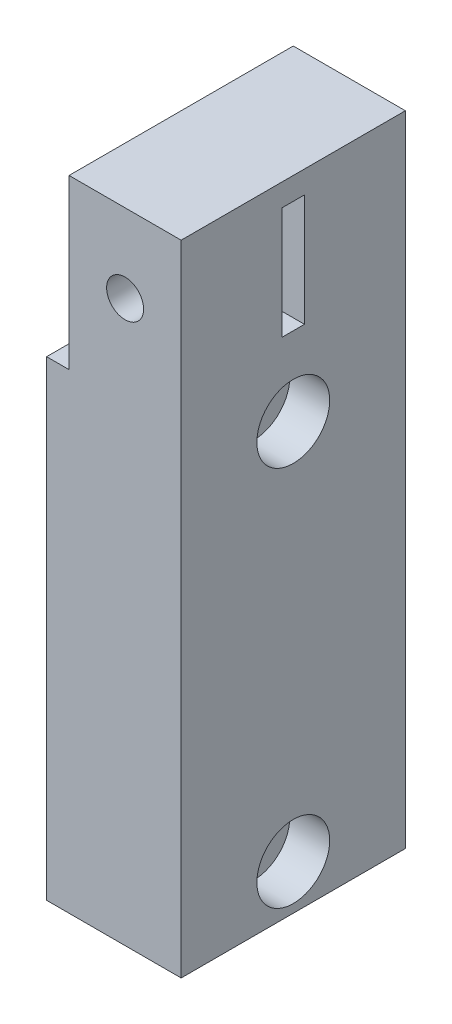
ISO-10303-21;
HEADER;
FILE_DESCRIPTION(('STEP AP214'),'2;1');
FILE_NAME('part.step','',(''),(''),'','','');
FILE_SCHEMA(('AUTOMOTIVE_DESIGN { 1 0 10303 214 1 1 1 1 }'));
ENDSEC;
DATA;
#1=APPLICATION_CONTEXT('core data for automotive mechanical design processes');
#2=APPLICATION_PROTOCOL_DEFINITION('international standard','automotive_design',2000,#1);
#3=PRODUCT_CONTEXT('',#1,'mechanical');
#4=PRODUCT('Part','Part','',(#3));
#5=PRODUCT_RELATED_PRODUCT_CATEGORY('part','',(#4));
#6=PRODUCT_DEFINITION_FORMATION('','',#4);
#7=PRODUCT_DEFINITION_CONTEXT('part definition',#1,'design');
#8=PRODUCT_DEFINITION('design','',#6,#7);
#9=PRODUCT_DEFINITION_SHAPE('','',#8);
#10=(LENGTH_UNIT() NAMED_UNIT(*) SI_UNIT(.MILLI.,.METRE.));
#11=(NAMED_UNIT(*) PLANE_ANGLE_UNIT() SI_UNIT($,.RADIAN.));
#12=(NAMED_UNIT(*) SI_UNIT($,.STERADIAN.) SOLID_ANGLE_UNIT());
#13=UNCERTAINTY_MEASURE_WITH_UNIT(LENGTH_MEASURE(1.E-05),#10,'distance_accuracy_value','');
#14=(GEOMETRIC_REPRESENTATION_CONTEXT(3) GLOBAL_UNCERTAINTY_ASSIGNED_CONTEXT((#13)) GLOBAL_UNIT_ASSIGNED_CONTEXT((#10,
#11,#12)) REPRESENTATION_CONTEXT('',''));
#15=CARTESIAN_POINT('',(0.,0.,0.));
#16=DIRECTION('',(0.,0.,1.));
#17=DIRECTION('',(1.,0.,0.));
#18=AXIS2_PLACEMENT_3D('',#15,#16,#17);
#19=CARTESIAN_POINT('',(-8.,3.99999999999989,10.));
#20=DIRECTION('',(1.,0.,0.));
#21=DIRECTION('',(0.,0.,-1.));
#22=AXIS2_PLACEMENT_3D('',#19,#20,#21);
#23=CYLINDRICAL_SURFACE('',#22,1.75);
#24=CARTESIAN_POINT('',(8.44,3.99999999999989,10.));
#25=DIRECTION('',(1.,0.,0.));
#26=DIRECTION('',(0.,0.,-1.));
#27=AXIS2_PLACEMENT_3D('',#24,#25,#26);
#28=CIRCLE('',#27,1.75);
#29=CARTESIAN_POINT('',(8.44,3.99999999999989,8.25));
#30=VERTEX_POINT('',#29);
#31=EDGE_CURVE('E165',#30,#30,#28,.F.);
#32=ORIENTED_EDGE('',*,*,#31,.F.);
#33=EDGE_LOOP('',(#32));
#34=FACE_BOUND('',#33,.T.);
#35=CARTESIAN_POINT('',(2.,3.99999999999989,10.));
#36=DIRECTION('',(-1.,0.,0.));
#37=DIRECTION('',(0.,0.,1.));
#38=AXIS2_PLACEMENT_3D('',#35,#36,#37);
#39=CIRCLE('',#38,1.75);
#40=CARTESIAN_POINT('',(2.,3.99999999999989,11.75));
#41=VERTEX_POINT('',#40);
#42=EDGE_CURVE('E12',#41,#41,#39,.F.);
#43=ORIENTED_EDGE('',*,*,#42,.F.);
#44=EDGE_LOOP('',(#43));
#45=FACE_BOUND('',#44,.T.);
#46=ADVANCED_FACE('F33',(#34,#45),#23,.F.);
#47=CARTESIAN_POINT('',(-8.,37.9999999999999,10.));
#48=DIRECTION('',(1.,0.,0.));
#49=DIRECTION('',(0.,0.,-1.));
#50=AXIS2_PLACEMENT_3D('',#47,#48,#49);
#51=CYLINDRICAL_SURFACE('',#50,1.75);
#52=CARTESIAN_POINT('',(8.44,37.9999999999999,10.));
#53=DIRECTION('',(1.,0.,0.));
#54=DIRECTION('',(0.,0.,-1.));
#55=AXIS2_PLACEMENT_3D('',#52,#53,#54);
#56=CIRCLE('',#55,1.75);
#57=CARTESIAN_POINT('',(8.44,37.9999999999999,8.25));
#58=VERTEX_POINT('',#57);
#59=EDGE_CURVE('E170',#58,#58,#56,.F.);
#60=ORIENTED_EDGE('',*,*,#59,.F.);
#61=EDGE_LOOP('',(#60));
#62=FACE_BOUND('',#61,.T.);
#63=CARTESIAN_POINT('',(2.,37.9999999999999,10.));
#64=DIRECTION('',(-1.,0.,0.));
#65=DIRECTION('',(0.,0.,1.));
#66=AXIS2_PLACEMENT_3D('',#63,#64,#65);
#67=CIRCLE('',#66,1.75);
#68=CARTESIAN_POINT('',(2.,37.9999999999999,11.75));
#69=VERTEX_POINT('',#68);
#70=EDGE_CURVE('E42',#69,#69,#67,.F.);
#71=ORIENTED_EDGE('',*,*,#70,.F.);
#72=EDGE_LOOP('',(#71));
#73=FACE_BOUND('',#72,.T.);
#74=ADVANCED_FACE('F295',(#62,#73),#51,.F.);
#75=CARTESIAN_POINT('',(0.,0.,20.));
#76=DIRECTION('',(0.,1.,0.));
#77=DIRECTION('',(0.,0.,1.));
#78=AXIS2_PLACEMENT_3D('',#75,#76,#77);
#79=PLANE('',#78);
#80=DIRECTION('',(1.,0.,0.));
#81=VECTOR('',#80,1.);
#82=CARTESIAN_POINT('',(0.,0.,2.));
#83=LINE('',#82,#81);
#84=CARTESIAN_POINT('',(0.,0.,2.));
#85=VERTEX_POINT('',#84);
#86=CARTESIAN_POINT('',(2.,0.,2.));
#87=VERTEX_POINT('',#86);
#88=EDGE_CURVE('E250',#85,#87,#83,.T.);
#89=ORIENTED_EDGE('',*,*,#88,.F.);
#90=DIRECTION('',(0.,0.,-1.));
#91=VECTOR('',#90,1.);
#92=CARTESIAN_POINT('',(0.,0.,20.));
#93=LINE('',#92,#91);
#94=CARTESIAN_POINT('',(0.,0.,0.));
#95=VERTEX_POINT('',#94);
#96=EDGE_CURVE('E194',#85,#95,#93,.T.);
#97=ORIENTED_EDGE('',*,*,#96,.T.);
#98=DIRECTION('',(1.,0.,0.));
#99=VECTOR('',#98,1.);
#100=CARTESIAN_POINT('',(0.,0.,0.));
#101=LINE('',#100,#99);
#102=CARTESIAN_POINT('',(12.,0.,0.));
#103=VERTEX_POINT('',#102);
#104=EDGE_CURVE('E210',#95,#103,#101,.T.);
#105=ORIENTED_EDGE('',*,*,#104,.T.);
#106=DIRECTION('',(0.,0.,-1.));
#107=VECTOR('',#106,1.);
#108=CARTESIAN_POINT('',(12.,0.,20.));
#109=LINE('',#108,#107);
#110=CARTESIAN_POINT('',(12.,0.,20.));
#111=VERTEX_POINT('',#110);
#112=EDGE_CURVE('E183',#111,#103,#109,.T.);
#113=ORIENTED_EDGE('',*,*,#112,.F.);
#114=DIRECTION('',(1.,0.,0.));
#115=VECTOR('',#114,1.);
#116=CARTESIAN_POINT('',(0.,0.,20.));
#117=LINE('',#116,#115);
#118=CARTESIAN_POINT('',(0.,0.,20.));
#119=VERTEX_POINT('',#118);
#120=EDGE_CURVE('E198',#119,#111,#117,.T.);
#121=ORIENTED_EDGE('',*,*,#120,.F.);
#122=CARTESIAN_POINT('',(0.,0.,18.));
#123=VERTEX_POINT('',#122);
#124=EDGE_CURVE('E192',#119,#123,#93,.T.);
#125=ORIENTED_EDGE('',*,*,#124,.T.);
#126=DIRECTION('',(-1.,0.,0.));
#127=VECTOR('',#126,1.);
#128=CARTESIAN_POINT('',(0.,0.,18.));
#129=LINE('',#128,#127);
#130=CARTESIAN_POINT('',(2.,0.,18.));
#131=VERTEX_POINT('',#130);
#132=EDGE_CURVE('E55',#131,#123,#129,.T.);
#133=ORIENTED_EDGE('',*,*,#132,.F.);
#134=DIRECTION('',(0.,0.,1.));
#135=VECTOR('',#134,1.);
#136=CARTESIAN_POINT('',(2.,0.,20.));
#137=LINE('',#136,#135);
#138=EDGE_CURVE('E50',#87,#131,#137,.T.);
#139=ORIENTED_EDGE('',*,*,#138,.F.);
#140=EDGE_LOOP('',(#89,#97,#105,#113,#121,#125,#133,#139));
#141=FACE_BOUND('',#140,.T.);
#142=ADVANCED_FACE('F35',(#141),#79,.F.);
#143=CARTESIAN_POINT('',(0.,42.,20.));
#144=DIRECTION('',(0.,-1.,0.));
#145=DIRECTION('',(0.,0.,-1.));
#146=AXIS2_PLACEMENT_3D('',#143,#144,#145);
#147=PLANE('',#146);
#148=DIRECTION('',(-1.,0.,0.));
#149=VECTOR('',#148,1.);
#150=CARTESIAN_POINT('',(0.,42.,2.));
#151=LINE('',#150,#149);
#152=CARTESIAN_POINT('',(2.,42.,2.));
#153=VERTEX_POINT('',#152);
#154=CARTESIAN_POINT('',(0.,42.,2.));
#155=VERTEX_POINT('',#154);
#156=EDGE_CURVE('E254',#153,#155,#151,.T.);
#157=ORIENTED_EDGE('',*,*,#156,.F.);
#158=DIRECTION('',(0.,0.,-1.));
#159=VECTOR('',#158,1.);
#160=CARTESIAN_POINT('',(2.,42.,20.));
#161=LINE('',#160,#159);
#162=CARTESIAN_POINT('',(2.,42.,0.));
#163=VERTEX_POINT('',#162);
#164=EDGE_CURVE('E144',#153,#163,#161,.T.);
#165=ORIENTED_EDGE('',*,*,#164,.T.);
#166=DIRECTION('',(-1.,0.,0.));
#167=VECTOR('',#166,1.);
#168=CARTESIAN_POINT('',(0.,42.,0.));
#169=LINE('',#168,#167);
#170=CARTESIAN_POINT('',(0.,42.,0.));
#171=VERTEX_POINT('',#170);
#172=EDGE_CURVE('E199',#163,#171,#169,.T.);
#173=ORIENTED_EDGE('',*,*,#172,.T.);
#174=DIRECTION('',(0.,0.,-1.));
#175=VECTOR('',#174,1.);
#176=CARTESIAN_POINT('',(0.,42.,20.));
#177=LINE('',#176,#175);
#178=EDGE_CURVE('E145',#155,#171,#177,.T.);
#179=ORIENTED_EDGE('',*,*,#178,.F.);
#180=EDGE_LOOP('',(#157,#165,#173,#179));
#181=FACE_BOUND('',#180,.T.);
#182=ADVANCED_FACE('F336',(#181),#147,.F.);
#183=DIRECTION('',(1.,0.,0.));
#184=VECTOR('',#183,1.);
#185=CARTESIAN_POINT('',(0.,42.,18.));
#186=LINE('',#185,#184);
#187=CARTESIAN_POINT('',(0.,42.0000000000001,18.));
#188=VERTEX_POINT('',#187);
#189=CARTESIAN_POINT('',(2.,42.,18.));
#190=VERTEX_POINT('',#189);
#191=EDGE_CURVE('E148',#188,#190,#186,.T.);
#192=ORIENTED_EDGE('',*,*,#191,.F.);
#193=CARTESIAN_POINT('',(0.,42.,20.));
#194=VERTEX_POINT('',#193);
#195=EDGE_CURVE('E135',#194,#188,#177,.T.);
#196=ORIENTED_EDGE('',*,*,#195,.F.);
#197=DIRECTION('',(-1.,0.,0.));
#198=VECTOR('',#197,1.);
#199=CARTESIAN_POINT('',(0.,42.,20.));
#200=LINE('',#199,#198);
#201=CARTESIAN_POINT('',(2.,42.,20.));
#202=VERTEX_POINT('',#201);
#203=EDGE_CURVE('E215',#202,#194,#200,.T.);
#204=ORIENTED_EDGE('',*,*,#203,.F.);
#205=EDGE_CURVE('E151',#202,#190,#161,.T.);
#206=ORIENTED_EDGE('',*,*,#205,.T.);
#207=EDGE_LOOP('',(#192,#196,#204,#206));
#208=FACE_BOUND('',#207,.T.);
#209=ADVANCED_FACE('F149',(#208),#147,.F.);
#210=CARTESIAN_POINT('',(0.,0.,20.));
#211=DIRECTION('',(1.,0.,0.));
#212=DIRECTION('',(0.,0.,-1.));
#213=AXIS2_PLACEMENT_3D('',#210,#211,#212);
#214=PLANE('',#213);
#215=DIRECTION('',(0.,-1.,0.));
#216=VECTOR('',#215,1.);
#217=CARTESIAN_POINT('',(0.,0.,2.));
#218=LINE('',#217,#216);
#219=EDGE_CURVE('E157',#155,#85,#218,.T.);
#220=ORIENTED_EDGE('',*,*,#219,.F.);
#221=ORIENTED_EDGE('',*,*,#178,.T.);
#222=DIRECTION('',(0.,-1.,0.));
#223=VECTOR('',#222,1.);
#224=CARTESIAN_POINT('',(0.,0.,0.));
#225=LINE('',#224,#223);
#226=EDGE_CURVE('E195',#171,#95,#225,.T.);
#227=ORIENTED_EDGE('',*,*,#226,.T.);
#228=ORIENTED_EDGE('',*,*,#96,.F.);
#229=EDGE_LOOP('',(#220,#221,#227,#228));
#230=FACE_BOUND('',#229,.T.);
#231=ADVANCED_FACE('F332',(#230),#214,.F.);
#232=DIRECTION('',(0.,1.,0.));
#233=VECTOR('',#232,1.);
#234=CARTESIAN_POINT('',(0.,0.,18.));
#235=LINE('',#234,#233);
#236=EDGE_CURVE('E140',#123,#188,#235,.T.);
#237=ORIENTED_EDGE('',*,*,#236,.F.);
#238=ORIENTED_EDGE('',*,*,#124,.F.);
#239=DIRECTION('',(0.,-1.,0.));
#240=VECTOR('',#239,1.);
#241=CARTESIAN_POINT('',(0.,0.,20.));
#242=LINE('',#241,#240);
#243=EDGE_CURVE('E141',#194,#119,#242,.T.);
#244=ORIENTED_EDGE('',*,*,#243,.F.);
#245=ORIENTED_EDGE('',*,*,#195,.T.);
#246=EDGE_LOOP('',(#237,#238,#244,#245));
#247=FACE_BOUND('',#246,.T.);
#248=ADVANCED_FACE('F137',(#247),#214,.F.);
#249=CARTESIAN_POINT('',(12.,0.,20.));
#250=DIRECTION('',(-1.,0.,0.));
#251=DIRECTION('',(0.,0.,1.));
#252=AXIS2_PLACEMENT_3D('',#249,#250,#251);
#253=PLANE('',#252);
#254=CARTESIAN_POINT('',(12.,3.99999999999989,10.));
#255=DIRECTION('',(1.,0.,0.));
#256=DIRECTION('',(0.,0.,-1.));
#257=AXIS2_PLACEMENT_3D('',#254,#255,#256);
#258=CIRCLE('',#257,3.25);
#259=CARTESIAN_POINT('',(12.,3.99999999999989,6.75));
#260=VERTEX_POINT('',#259);
#261=EDGE_CURVE('E247',#260,#260,#258,.T.);
#262=ORIENTED_EDGE('',*,*,#261,.F.);
#263=EDGE_LOOP('',(#262));
#264=FACE_BOUND('',#263,.T.);
#265=CARTESIAN_POINT('',(12.,37.9999999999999,10.));
#266=DIRECTION('',(1.,0.,0.));
#267=DIRECTION('',(0.,0.,-1.));
#268=AXIS2_PLACEMENT_3D('',#265,#266,#267);
#269=CIRCLE('',#268,3.25);
#270=CARTESIAN_POINT('',(12.,37.9999999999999,6.75));
#271=VERTEX_POINT('',#270);
#272=EDGE_CURVE('E168',#271,#271,#269,.T.);
#273=ORIENTED_EDGE('',*,*,#272,.F.);
#274=EDGE_LOOP('',(#273));
#275=FACE_BOUND('',#274,.T.);
#276=DIRECTION('',(0.,0.,-1.));
#277=VECTOR('',#276,1.);
#278=CARTESIAN_POINT('',(12.,45.,11.));
#279=LINE('',#278,#277);
#280=CARTESIAN_POINT('',(12.,45.,11.));
#281=VERTEX_POINT('',#280);
#282=CARTESIAN_POINT('',(12.,45.,9.));
#283=VERTEX_POINT('',#282);
#284=EDGE_CURVE('E239',#281,#283,#279,.T.);
#285=ORIENTED_EDGE('',*,*,#284,.F.);
#286=DIRECTION('',(0.,-1.,0.));
#287=VECTOR('',#286,1.);
#288=CARTESIAN_POINT('',(12.,45.,11.));
#289=LINE('',#288,#287);
#290=CARTESIAN_POINT('',(12.,55.,11.));
#291=VERTEX_POINT('',#290);
#292=EDGE_CURVE('E172',#291,#281,#289,.T.);
#293=ORIENTED_EDGE('',*,*,#292,.F.);
#294=DIRECTION('',(0.,0.,1.));
#295=VECTOR('',#294,1.);
#296=CARTESIAN_POINT('',(12.,55.,11.));
#297=LINE('',#296,#295);
#298=CARTESIAN_POINT('',(12.,55.,9.));
#299=VERTEX_POINT('',#298);
#300=EDGE_CURVE('E229',#299,#291,#297,.T.);
#301=ORIENTED_EDGE('',*,*,#300,.F.);
#302=DIRECTION('',(0.,1.,0.));
#303=VECTOR('',#302,1.);
#304=CARTESIAN_POINT('',(12.,45.,9.));
#305=LINE('',#304,#303);
#306=EDGE_CURVE('E236',#283,#299,#305,.T.);
#307=ORIENTED_EDGE('',*,*,#306,.F.);
#308=EDGE_LOOP('',(#285,#293,#301,#307));
#309=FACE_BOUND('',#308,.T.);
#310=DIRECTION('',(0.,1.,0.));
#311=VECTOR('',#310,1.);
#312=CARTESIAN_POINT('',(12.,0.,0.));
#313=LINE('',#312,#311);
#314=CARTESIAN_POINT('',(12.,57.,0.));
#315=VERTEX_POINT('',#314);
#316=EDGE_CURVE('E208',#103,#315,#313,.T.);
#317=ORIENTED_EDGE('',*,*,#316,.T.);
#318=DIRECTION('',(0.,0.,-1.));
#319=VECTOR('',#318,1.);
#320=CARTESIAN_POINT('',(12.,57.,20.));
#321=LINE('',#320,#319);
#322=CARTESIAN_POINT('',(12.,57.,20.));
#323=VERTEX_POINT('',#322);
#324=EDGE_CURVE('E186',#323,#315,#321,.T.);
#325=ORIENTED_EDGE('',*,*,#324,.F.);
#326=DIRECTION('',(0.,1.,0.));
#327=VECTOR('',#326,1.);
#328=CARTESIAN_POINT('',(12.,0.,20.));
#329=LINE('',#328,#327);
#330=EDGE_CURVE('E221',#111,#323,#329,.T.);
#331=ORIENTED_EDGE('',*,*,#330,.F.);
#332=ORIENTED_EDGE('',*,*,#112,.T.);
#333=EDGE_LOOP('',(#317,#325,#331,#332));
#334=FACE_BOUND('',#333,.T.);
#335=ADVANCED_FACE('F345',(#264,#275,#309,#334),#253,.F.);
#336=CARTESIAN_POINT('',(2.,57.,20.));
#337=DIRECTION('',(0.,-1.,0.));
#338=DIRECTION('',(0.,0.,-1.));
#339=AXIS2_PLACEMENT_3D('',#336,#337,#338);
#340=PLANE('',#339);
#341=DIRECTION('',(-1.,0.,0.));
#342=VECTOR('',#341,1.);
#343=CARTESIAN_POINT('',(2.,57.,0.));
#344=LINE('',#343,#342);
#345=CARTESIAN_POINT('',(2.,57.,0.));
#346=VERTEX_POINT('',#345);
#347=EDGE_CURVE('E205',#315,#346,#344,.T.);
#348=ORIENTED_EDGE('',*,*,#347,.T.);
#349=DIRECTION('',(0.,0.,-1.));
#350=VECTOR('',#349,1.);
#351=CARTESIAN_POINT('',(2.,57.,20.));
#352=LINE('',#351,#350);
#353=CARTESIAN_POINT('',(2.,57.,20.));
#354=VERTEX_POINT('',#353);
#355=EDGE_CURVE('E189',#354,#346,#352,.T.);
#356=ORIENTED_EDGE('',*,*,#355,.F.);
#357=DIRECTION('',(-1.,0.,0.));
#358=VECTOR('',#357,1.);
#359=CARTESIAN_POINT('',(2.,57.,20.));
#360=LINE('',#359,#358);
#361=EDGE_CURVE('E219',#323,#354,#360,.T.);
#362=ORIENTED_EDGE('',*,*,#361,.F.);
#363=ORIENTED_EDGE('',*,*,#324,.T.);
#364=EDGE_LOOP('',(#348,#356,#362,#363));
#365=FACE_BOUND('',#364,.T.);
#366=ADVANCED_FACE('F342',(#365),#340,.F.);
#367=CARTESIAN_POINT('',(2.,42.,20.));
#368=DIRECTION('',(1.,0.,0.));
#369=DIRECTION('',(0.,0.,-1.));
#370=AXIS2_PLACEMENT_3D('',#367,#368,#369);
#371=PLANE('',#370);
#372=DIRECTION('',(0.,0.,1.));
#373=VECTOR('',#372,1.);
#374=CARTESIAN_POINT('',(2.,55.,20.));
#375=LINE('',#374,#373);
#376=CARTESIAN_POINT('',(2.,55.,9.));
#377=VERTEX_POINT('',#376);
#378=CARTESIAN_POINT('',(2.,55.,11.));
#379=VERTEX_POINT('',#378);
#380=EDGE_CURVE('E162',#377,#379,#375,.T.);
#381=ORIENTED_EDGE('',*,*,#380,.T.);
#382=DIRECTION('',(0.,-1.,0.));
#383=VECTOR('',#382,1.);
#384=CARTESIAN_POINT('',(2.,42.,11.));
#385=LINE('',#384,#383);
#386=CARTESIAN_POINT('',(2.,45.,11.));
#387=VERTEX_POINT('',#386);
#388=EDGE_CURVE('E158',#379,#387,#385,.T.);
#389=ORIENTED_EDGE('',*,*,#388,.T.);
#390=DIRECTION('',(0.,0.,-1.));
#391=VECTOR('',#390,1.);
#392=CARTESIAN_POINT('',(2.,45.,20.));
#393=LINE('',#392,#391);
#394=CARTESIAN_POINT('',(2.,45.,9.));
#395=VERTEX_POINT('',#394);
#396=EDGE_CURVE('E180',#387,#395,#393,.T.);
#397=ORIENTED_EDGE('',*,*,#396,.T.);
#398=DIRECTION('',(0.,1.,0.));
#399=VECTOR('',#398,1.);
#400=CARTESIAN_POINT('',(2.,42.,9.));
#401=LINE('',#400,#399);
#402=EDGE_CURVE('E177',#395,#377,#401,.T.);
#403=ORIENTED_EDGE('',*,*,#402,.T.);
#404=EDGE_LOOP('',(#381,#389,#397,#403));
#405=FACE_BOUND('',#404,.T.);
#406=ORIENTED_EDGE('',*,*,#355,.T.);
#407=DIRECTION('',(0.,-1.,0.));
#408=VECTOR('',#407,1.);
#409=CARTESIAN_POINT('',(2.,42.,0.));
#410=LINE('',#409,#408);
#411=EDGE_CURVE('E202',#346,#163,#410,.T.);
#412=ORIENTED_EDGE('',*,*,#411,.T.);
#413=ORIENTED_EDGE('',*,*,#164,.F.);
#414=DIRECTION('',(0.,-1.,0.));
#415=VECTOR('',#414,1.);
#416=CARTESIAN_POINT('',(2.,200.234170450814,2.));
#417=LINE('',#416,#415);
#418=EDGE_CURVE('E261',#153,#87,#417,.T.);
#419=ORIENTED_EDGE('',*,*,#418,.T.);
#420=ORIENTED_EDGE('',*,*,#138,.T.);
#421=DIRECTION('',(0.,-1.,0.));
#422=VECTOR('',#421,1.);
#423=CARTESIAN_POINT('',(2.,200.234170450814,18.));
#424=LINE('',#423,#422);
#425=EDGE_CURVE('E264',#190,#131,#424,.T.);
#426=ORIENTED_EDGE('',*,*,#425,.F.);
#427=ORIENTED_EDGE('',*,*,#205,.F.);
#428=DIRECTION('',(0.,-1.,0.));
#429=VECTOR('',#428,1.);
#430=CARTESIAN_POINT('',(2.,42.,20.));
#431=LINE('',#430,#429);
#432=EDGE_CURVE('E217',#354,#202,#431,.T.);
#433=ORIENTED_EDGE('',*,*,#432,.F.);
#434=EDGE_LOOP('',(#406,#412,#413,#419,#420,#426,#427,#433));
#435=FACE_BOUND('',#434,.T.);
#436=ORIENTED_EDGE('',*,*,#70,.T.);
#437=EDGE_LOOP('',(#436));
#438=FACE_BOUND('',#437,.T.);
#439=ORIENTED_EDGE('',*,*,#42,.T.);
#440=EDGE_LOOP('',(#439));
#441=FACE_BOUND('',#440,.T.);
#442=ADVANCED_FACE('F328',(#405,#435,#438,#441),#371,.F.);
#443=CARTESIAN_POINT('',(12.,0.,20.));
#444=DIRECTION('',(0.,0.,1.));
#445=DIRECTION('',(1.,0.,0.));
#446=AXIS2_PLACEMENT_3D('',#443,#444,#445);
#447=PLANE('',#446);
#448=CARTESIAN_POINT('',(7.,50.,20.));
#449=DIRECTION('',(0.,0.,1.));
#450=DIRECTION('',(1.,0.,0.));
#451=AXIS2_PLACEMENT_3D('',#448,#449,#450);
#452=CIRCLE('',#451,1.64999999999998);
#453=CARTESIAN_POINT('',(8.64999999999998,50.,20.));
#454=VERTEX_POINT('',#453);
#455=EDGE_CURVE('E269',#454,#454,#452,.T.);
#456=ORIENTED_EDGE('',*,*,#455,.F.);
#457=EDGE_LOOP('',(#456));
#458=FACE_BOUND('',#457,.T.);
#459=ORIENTED_EDGE('',*,*,#120,.T.);
#460=ORIENTED_EDGE('',*,*,#330,.T.);
#461=ORIENTED_EDGE('',*,*,#361,.T.);
#462=ORIENTED_EDGE('',*,*,#432,.T.);
#463=ORIENTED_EDGE('',*,*,#203,.T.);
#464=ORIENTED_EDGE('',*,*,#243,.T.);
#465=EDGE_LOOP('',(#459,#460,#461,#462,#463,#464));
#466=FACE_BOUND('',#465,.T.);
#467=ADVANCED_FACE('F325',(#458,#466),#447,.T.);
#468=CARTESIAN_POINT('',(12.,0.,0.));
#469=DIRECTION('',(0.,0.,1.));
#470=DIRECTION('',(1.,0.,0.));
#471=AXIS2_PLACEMENT_3D('',#468,#469,#470);
#472=PLANE('',#471);
#473=CARTESIAN_POINT('',(7.,50.,0.));
#474=DIRECTION('',(0.,0.,1.));
#475=DIRECTION('',(1.,0.,0.));
#476=AXIS2_PLACEMENT_3D('',#473,#474,#475);
#477=CIRCLE('',#476,1.64999999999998);
#478=CARTESIAN_POINT('',(8.64999999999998,50.,0.));
#479=VERTEX_POINT('',#478);
#480=EDGE_CURVE('E272',#479,#479,#477,.T.);
#481=ORIENTED_EDGE('',*,*,#480,.T.);
#482=EDGE_LOOP('',(#481));
#483=FACE_BOUND('',#482,.T.);
#484=ORIENTED_EDGE('',*,*,#104,.F.);
#485=ORIENTED_EDGE('',*,*,#226,.F.);
#486=ORIENTED_EDGE('',*,*,#172,.F.);
#487=ORIENTED_EDGE('',*,*,#411,.F.);
#488=ORIENTED_EDGE('',*,*,#347,.F.);
#489=ORIENTED_EDGE('',*,*,#316,.F.);
#490=EDGE_LOOP('',(#484,#485,#486,#487,#488,#489));
#491=FACE_BOUND('',#490,.T.);
#492=ADVANCED_FACE('F323',(#483,#491),#472,.F.);
#493=CARTESIAN_POINT('',(-8.,45.,11.));
#494=DIRECTION('',(0.,0.,1.));
#495=DIRECTION('',(1.,0.,0.));
#496=AXIS2_PLACEMENT_3D('',#493,#494,#495);
#497=PLANE('',#496);
#498=CARTESIAN_POINT('',(7.,50.,11.));
#499=DIRECTION('',(0.,0.,1.));
#500=DIRECTION('',(1.,0.,0.));
#501=AXIS2_PLACEMENT_3D('',#498,#499,#500);
#502=CIRCLE('',#501,1.64999999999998);
#503=CARTESIAN_POINT('',(8.64999999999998,50.,11.));
#504=VERTEX_POINT('',#503);
#505=EDGE_CURVE('E266',#504,#504,#502,.T.);
#506=ORIENTED_EDGE('',*,*,#505,.T.);
#507=EDGE_LOOP('',(#506));
#508=FACE_BOUND('',#507,.T.);
#509=DIRECTION('',(1.,0.,0.));
#510=VECTOR('',#509,1.);
#511=CARTESIAN_POINT('',(-8.,55.,11.));
#512=LINE('',#511,#510);
#513=EDGE_CURVE('E213',#379,#291,#512,.T.);
#514=ORIENTED_EDGE('',*,*,#513,.T.);
#515=ORIENTED_EDGE('',*,*,#292,.T.);
#516=DIRECTION('',(1.,0.,0.));
#517=VECTOR('',#516,1.);
#518=CARTESIAN_POINT('',(-8.,45.,11.));
#519=LINE('',#518,#517);
#520=EDGE_CURVE('E225',#387,#281,#519,.T.);
#521=ORIENTED_EDGE('',*,*,#520,.F.);
#522=ORIENTED_EDGE('',*,*,#388,.F.);
#523=EDGE_LOOP('',(#514,#515,#521,#522));
#524=FACE_BOUND('',#523,.T.);
#525=ADVANCED_FACE('F312',(#508,#524),#497,.F.);
#526=CARTESIAN_POINT('',(-8.,55.,11.));
#527=DIRECTION('',(0.,1.,0.));
#528=DIRECTION('',(0.,0.,1.));
#529=AXIS2_PLACEMENT_3D('',#526,#527,#528);
#530=PLANE('',#529);
#531=DIRECTION('',(1.,0.,0.));
#532=VECTOR('',#531,1.);
#533=CARTESIAN_POINT('',(-8.,55.,9.));
#534=LINE('',#533,#532);
#535=EDGE_CURVE('E231',#377,#299,#534,.T.);
#536=ORIENTED_EDGE('',*,*,#535,.T.);
#537=ORIENTED_EDGE('',*,*,#300,.T.);
#538=ORIENTED_EDGE('',*,*,#513,.F.);
#539=ORIENTED_EDGE('',*,*,#380,.F.);
#540=EDGE_LOOP('',(#536,#537,#538,#539));
#541=FACE_BOUND('',#540,.T.);
#542=ADVANCED_FACE('F309',(#541),#530,.F.);
#543=CARTESIAN_POINT('',(-8.,45.,9.));
#544=DIRECTION('',(0.,0.,-1.));
#545=DIRECTION('',(-1.,0.,0.));
#546=AXIS2_PLACEMENT_3D('',#543,#544,#545);
#547=PLANE('',#546);
#548=CARTESIAN_POINT('',(7.,50.,9.));
#549=DIRECTION('',(0.,0.,-1.));
#550=DIRECTION('',(-1.,0.,0.));
#551=AXIS2_PLACEMENT_3D('',#548,#549,#550);
#552=CIRCLE('',#551,1.64999999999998);
#553=CARTESIAN_POINT('',(5.35000000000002,50.,9.));
#554=VERTEX_POINT('',#553);
#555=EDGE_CURVE('E37',#554,#554,#552,.T.);
#556=ORIENTED_EDGE('',*,*,#555,.T.);
#557=EDGE_LOOP('',(#556));
#558=FACE_BOUND('',#557,.T.);
#559=DIRECTION('',(1.,0.,0.));
#560=VECTOR('',#559,1.);
#561=CARTESIAN_POINT('',(-8.,45.,9.));
#562=LINE('',#561,#560);
#563=EDGE_CURVE('E228',#395,#283,#562,.T.);
#564=ORIENTED_EDGE('',*,*,#563,.T.);
#565=ORIENTED_EDGE('',*,*,#306,.T.);
#566=ORIENTED_EDGE('',*,*,#535,.F.);
#567=ORIENTED_EDGE('',*,*,#402,.F.);
#568=EDGE_LOOP('',(#564,#565,#566,#567));
#569=FACE_BOUND('',#568,.T.);
#570=ADVANCED_FACE('F279',(#558,#569),#547,.F.);
#571=CARTESIAN_POINT('',(-8.,45.,11.));
#572=DIRECTION('',(0.,-1.,0.));
#573=DIRECTION('',(0.,0.,-1.));
#574=AXIS2_PLACEMENT_3D('',#571,#572,#573);
#575=PLANE('',#574);
#576=ORIENTED_EDGE('',*,*,#520,.T.);
#577=ORIENTED_EDGE('',*,*,#284,.T.);
#578=ORIENTED_EDGE('',*,*,#563,.F.);
#579=ORIENTED_EDGE('',*,*,#396,.F.);
#580=EDGE_LOOP('',(#576,#577,#578,#579));
#581=FACE_BOUND('',#580,.T.);
#582=ADVANCED_FACE('F316',(#581),#575,.F.);
#583=CARTESIAN_POINT('',(8.44,37.9999999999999,10.));
#584=DIRECTION('',(1.,0.,0.));
#585=DIRECTION('',(0.,0.,-1.));
#586=AXIS2_PLACEMENT_3D('',#583,#584,#585);
#587=PLANE('',#586);
#588=CARTESIAN_POINT('',(8.44,37.9999999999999,10.));
#589=DIRECTION('',(1.,0.,0.));
#590=DIRECTION('',(0.,0.,-1.));
#591=AXIS2_PLACEMENT_3D('',#588,#589,#590);
#592=CIRCLE('',#591,3.25);
#593=CARTESIAN_POINT('',(8.44,37.9999999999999,6.75));
#594=VERTEX_POINT('',#593);
#595=EDGE_CURVE('E173',#594,#594,#592,.T.);
#596=ORIENTED_EDGE('',*,*,#595,.T.);
#597=EDGE_LOOP('',(#596));
#598=FACE_BOUND('',#597,.T.);
#599=ORIENTED_EDGE('',*,*,#59,.T.);
#600=EDGE_LOOP('',(#599));
#601=FACE_BOUND('',#600,.T.);
#602=ADVANCED_FACE('F319',(#598,#601),#587,.T.);
#603=CARTESIAN_POINT('',(8.44,37.9999999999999,10.));
#604=DIRECTION('',(1.,0.,0.));
#605=DIRECTION('',(0.,0.,-1.));
#606=AXIS2_PLACEMENT_3D('',#603,#604,#605);
#607=CYLINDRICAL_SURFACE('',#606,3.25);
#608=ORIENTED_EDGE('',*,*,#595,.F.);
#609=EDGE_LOOP('',(#608));
#610=FACE_BOUND('',#609,.T.);
#611=ORIENTED_EDGE('',*,*,#272,.T.);
#612=EDGE_LOOP('',(#611));
#613=FACE_BOUND('',#612,.T.);
#614=ADVANCED_FACE('F306',(#610,#613),#607,.F.);
#615=CARTESIAN_POINT('',(8.44,3.99999999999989,10.));
#616=DIRECTION('',(1.,0.,0.));
#617=DIRECTION('',(0.,0.,-1.));
#618=AXIS2_PLACEMENT_3D('',#615,#616,#617);
#619=PLANE('',#618);
#620=CARTESIAN_POINT('',(8.44,3.99999999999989,10.));
#621=DIRECTION('',(1.,0.,0.));
#622=DIRECTION('',(0.,0.,-1.));
#623=AXIS2_PLACEMENT_3D('',#620,#621,#622);
#624=CIRCLE('',#623,3.25);
#625=CARTESIAN_POINT('',(8.44,3.99999999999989,6.75));
#626=VERTEX_POINT('',#625);
#627=EDGE_CURVE('E169',#626,#626,#624,.T.);
#628=ORIENTED_EDGE('',*,*,#627,.T.);
#629=EDGE_LOOP('',(#628));
#630=FACE_BOUND('',#629,.T.);
#631=ORIENTED_EDGE('',*,*,#31,.T.);
#632=EDGE_LOOP('',(#631));
#633=FACE_BOUND('',#632,.T.);
#634=ADVANCED_FACE('F386',(#630,#633),#619,.T.);
#635=CARTESIAN_POINT('',(8.44,3.99999999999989,10.));
#636=DIRECTION('',(1.,0.,0.));
#637=DIRECTION('',(0.,0.,-1.));
#638=AXIS2_PLACEMENT_3D('',#635,#636,#637);
#639=CYLINDRICAL_SURFACE('',#638,3.25);
#640=ORIENTED_EDGE('',*,*,#627,.F.);
#641=EDGE_LOOP('',(#640));
#642=FACE_BOUND('',#641,.T.);
#643=ORIENTED_EDGE('',*,*,#261,.T.);
#644=EDGE_LOOP('',(#643));
#645=FACE_BOUND('',#644,.T.);
#646=ADVANCED_FACE('F381',(#642,#645),#639,.F.);
#647=CARTESIAN_POINT('',(0.,200.234170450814,2.));
#648=DIRECTION('',(0.,0.,1.));
#649=DIRECTION('',(1.,0.,0.));
#650=AXIS2_PLACEMENT_3D('',#647,#648,#649);
#651=PLANE('',#650);
#652=ORIENTED_EDGE('',*,*,#219,.T.);
#653=ORIENTED_EDGE('',*,*,#88,.T.);
#654=ORIENTED_EDGE('',*,*,#418,.F.);
#655=ORIENTED_EDGE('',*,*,#156,.T.);
#656=EDGE_LOOP('',(#652,#653,#654,#655));
#657=FACE_BOUND('',#656,.T.);
#658=ADVANCED_FACE('F292',(#657),#651,.T.);
#659=CARTESIAN_POINT('',(0.,200.234170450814,18.));
#660=DIRECTION('',(0.,0.,-1.));
#661=DIRECTION('',(-1.,0.,0.));
#662=AXIS2_PLACEMENT_3D('',#659,#660,#661);
#663=PLANE('',#662);
#664=ORIENTED_EDGE('',*,*,#425,.T.);
#665=ORIENTED_EDGE('',*,*,#132,.T.);
#666=ORIENTED_EDGE('',*,*,#236,.T.);
#667=ORIENTED_EDGE('',*,*,#191,.T.);
#668=EDGE_LOOP('',(#664,#665,#666,#667));
#669=FACE_BOUND('',#668,.T.);
#670=ADVANCED_FACE('F156',(#669),#663,.T.);
#671=CARTESIAN_POINT('',(7.,50.,0.));
#672=DIRECTION('',(0.,0.,1.));
#673=DIRECTION('',(1.,0.,0.));
#674=AXIS2_PLACEMENT_3D('',#671,#672,#673);
#675=CYLINDRICAL_SURFACE('',#674,1.64999999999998);
#676=ORIENTED_EDGE('',*,*,#480,.F.);
#677=EDGE_LOOP('',(#676));
#678=FACE_BOUND('',#677,.T.);
#679=ORIENTED_EDGE('',*,*,#555,.F.);
#680=EDGE_LOOP('',(#679));
#681=FACE_BOUND('',#680,.T.);
#682=ADVANCED_FACE('F282',(#678,#681),#675,.F.);
#683=ORIENTED_EDGE('',*,*,#455,.T.);
#684=EDGE_LOOP('',(#683));
#685=FACE_BOUND('',#684,.T.);
#686=ORIENTED_EDGE('',*,*,#505,.F.);
#687=EDGE_LOOP('',(#686));
#688=FACE_BOUND('',#687,.T.);
#689=ADVANCED_FACE('F284',(#685,#688),#675,.F.);
#690=CLOSED_SHELL('',(#46,#74,#142,#182,#209,#231,#248,#335,#366,#442,#467,#492,#525,#542,#570,
#582,#602,#614,#634,#646,#658,#670,#682,#689));
#691=MANIFOLD_SOLID_BREP('B2',#690);
#692=ADVANCED_BREP_SHAPE_REPRESENTATION('',(#18,#691),#14);
#693=SHAPE_DEFINITION_REPRESENTATION(#9,#692);
ENDSEC;
END-ISO-10303-21;
